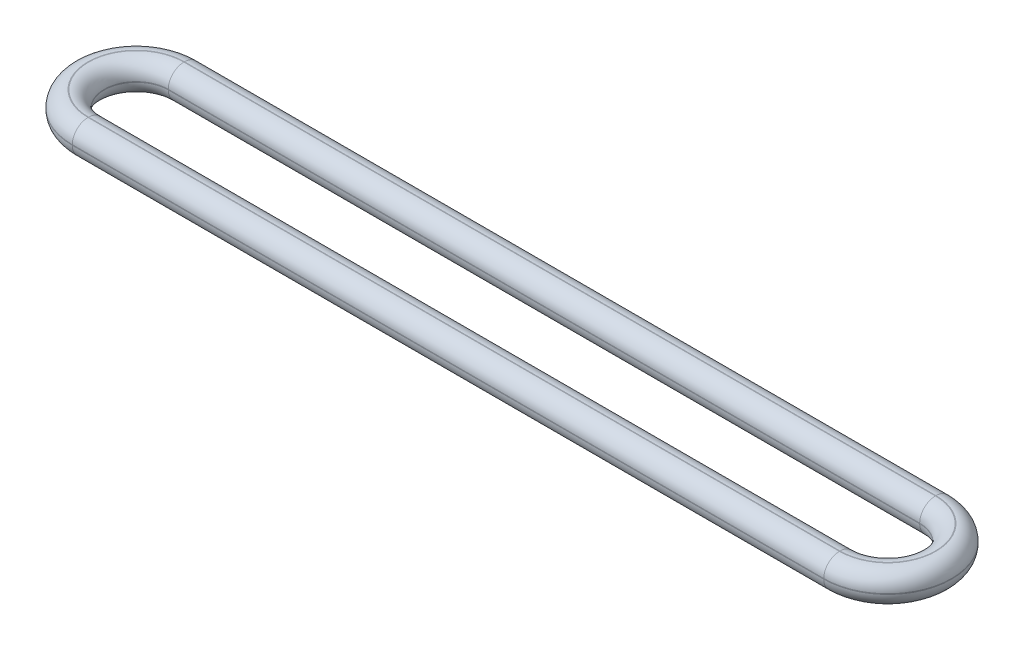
ISO-10303-21;
HEADER;
FILE_DESCRIPTION(('STEP AP214'),'2;1');
FILE_NAME('part.step','',(''),(''),'','','');
FILE_SCHEMA(('AUTOMOTIVE_DESIGN { 1 0 10303 214 1 1 1 1 }'));
ENDSEC;
DATA;
#1=APPLICATION_CONTEXT('core data for automotive mechanical design processes');
#2=APPLICATION_PROTOCOL_DEFINITION('international standard','automotive_design',2000,#1);
#3=PRODUCT_CONTEXT('',#1,'mechanical');
#4=PRODUCT('Part','Part','',(#3));
#5=PRODUCT_RELATED_PRODUCT_CATEGORY('part','',(#4));
#6=PRODUCT_DEFINITION_FORMATION('','',#4);
#7=PRODUCT_DEFINITION_CONTEXT('part definition',#1,'design');
#8=PRODUCT_DEFINITION('design','',#6,#7);
#9=PRODUCT_DEFINITION_SHAPE('','',#8);
#10=(LENGTH_UNIT() NAMED_UNIT(*) SI_UNIT(.MILLI.,.METRE.));
#11=(NAMED_UNIT(*) PLANE_ANGLE_UNIT() SI_UNIT($,.RADIAN.));
#12=(NAMED_UNIT(*) SI_UNIT($,.STERADIAN.) SOLID_ANGLE_UNIT());
#13=UNCERTAINTY_MEASURE_WITH_UNIT(LENGTH_MEASURE(1.E-05),#10,'distance_accuracy_value','');
#14=(GEOMETRIC_REPRESENTATION_CONTEXT(3) GLOBAL_UNCERTAINTY_ASSIGNED_CONTEXT((#13)) GLOBAL_UNIT_ASSIGNED_CONTEXT((#10,
#11,#12)) REPRESENTATION_CONTEXT('',''));
#15=CARTESIAN_POINT('',(0.,0.,0.));
#16=DIRECTION('',(0.,0.,1.));
#17=DIRECTION('',(1.,0.,0.));
#18=AXIS2_PLACEMENT_3D('',#15,#16,#17);
#19=CARTESIAN_POINT('',(0.,1.,0.));
#20=DIRECTION('',(0.,1.,0.));
#21=DIRECTION('',(0.,0.,1.));
#22=AXIS2_PLACEMENT_3D('',#19,#20,#21);
#23=PLANE('',#22);
#24=DIRECTION('',(-1.,0.,0.));
#25=VECTOR('',#24,1.);
#26=CARTESIAN_POINT('',(0.,1.,-1.49));
#27=LINE('',#26,#25);
#28=CARTESIAN_POINT('',(0.,1.,-1.49));
#29=VERTEX_POINT('',#28);
#30=CARTESIAN_POINT('',(23.5,1.,-1.49));
#31=VERTEX_POINT('',#30);
#32=EDGE_CURVE('E52',#29,#31,#27,.F.);
#33=ORIENTED_EDGE('',*,*,#32,.T.);
#34=CARTESIAN_POINT('',(23.5,1.,0.));
#35=DIRECTION('',(0.,1.,0.));
#36=DIRECTION('',(0.,0.,1.));
#37=AXIS2_PLACEMENT_3D('',#34,#35,#36);
#38=CIRCLE('',#37,1.49);
#39=CARTESIAN_POINT('',(23.5,1.,1.49));
#40=VERTEX_POINT('',#39);
#41=EDGE_CURVE('E237',#31,#40,#38,.F.);
#42=ORIENTED_EDGE('',*,*,#41,.T.);
#43=DIRECTION('',(1.,0.,0.));
#44=VECTOR('',#43,1.);
#45=CARTESIAN_POINT('',(0.,1.,1.49));
#46=LINE('',#45,#44);
#47=CARTESIAN_POINT('',(0.,1.,1.49));
#48=VERTEX_POINT('',#47);
#49=EDGE_CURVE('E233',#40,#48,#46,.F.);
#50=ORIENTED_EDGE('',*,*,#49,.T.);
#51=CARTESIAN_POINT('',(0.,1.,0.));
#52=DIRECTION('',(0.,1.,0.));
#53=DIRECTION('',(0.,0.,1.));
#54=AXIS2_PLACEMENT_3D('',#51,#52,#53);
#55=CIRCLE('',#54,1.49);
#56=EDGE_CURVE('E57',#48,#29,#55,.F.);
#57=ORIENTED_EDGE('',*,*,#56,.T.);
#58=EDGE_LOOP('',(#33,#42,#50,#57));
#59=FACE_BOUND('',#58,.T.);
#60=CARTESIAN_POINT('',(23.5,1.,0.));
#61=DIRECTION('',(0.,1.,0.));
#62=DIRECTION('',(0.,0.,1.));
#63=AXIS2_PLACEMENT_3D('',#60,#61,#62);
#64=CIRCLE('',#63,1.51);
#65=CARTESIAN_POINT('',(23.5,1.,1.51000000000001));
#66=VERTEX_POINT('',#65);
#67=CARTESIAN_POINT('',(23.5,1.,-1.51));
#68=VERTEX_POINT('',#67);
#69=EDGE_CURVE('E228',#66,#68,#64,.T.);
#70=ORIENTED_EDGE('',*,*,#69,.T.);
#71=DIRECTION('',(-1.,0.,0.));
#72=VECTOR('',#71,1.);
#73=CARTESIAN_POINT('',(0.,1.,-1.51));
#74=LINE('',#73,#72);
#75=CARTESIAN_POINT('',(0.,1.,-1.51));
#76=VERTEX_POINT('',#75);
#77=EDGE_CURVE('E230',#68,#76,#74,.T.);
#78=ORIENTED_EDGE('',*,*,#77,.T.);
#79=CARTESIAN_POINT('',(0.,1.,0.));
#80=DIRECTION('',(0.,1.,0.));
#81=DIRECTION('',(0.,0.,1.));
#82=AXIS2_PLACEMENT_3D('',#79,#80,#81);
#83=CIRCLE('',#82,1.51);
#84=CARTESIAN_POINT('',(0.,1.,1.51));
#85=VERTEX_POINT('',#84);
#86=EDGE_CURVE('E224',#76,#85,#83,.T.);
#87=ORIENTED_EDGE('',*,*,#86,.T.);
#88=DIRECTION('',(1.,0.,0.));
#89=VECTOR('',#88,1.);
#90=CARTESIAN_POINT('',(23.5,1.,1.51000000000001));
#91=LINE('',#90,#89);
#92=EDGE_CURVE('E226',#85,#66,#91,.T.);
#93=ORIENTED_EDGE('',*,*,#92,.T.);
#94=EDGE_LOOP('',(#70,#78,#87,#93));
#95=FACE_BOUND('',#94,.T.);
#96=ADVANCED_FACE('F35',(#59,#95),#23,.T.);
#97=CARTESIAN_POINT('',(0.,0.,0.));
#98=DIRECTION('',(0.,1.,0.));
#99=DIRECTION('',(0.,0.,1.));
#100=AXIS2_PLACEMENT_3D('',#97,#98,#99);
#101=PLANE('',#100);
#102=DIRECTION('',(-1.,0.,0.));
#103=VECTOR('',#102,1.);
#104=CARTESIAN_POINT('',(0.,0.,-1.49));
#105=LINE('',#104,#103);
#106=CARTESIAN_POINT('',(23.5,0.,-1.49));
#107=VERTEX_POINT('',#106);
#108=CARTESIAN_POINT('',(0.,0.,-1.49));
#109=VERTEX_POINT('',#108);
#110=EDGE_CURVE('E188',#107,#109,#105,.T.);
#111=ORIENTED_EDGE('',*,*,#110,.T.);
#112=CARTESIAN_POINT('',(0.,0.,0.));
#113=DIRECTION('',(0.,1.,0.));
#114=DIRECTION('',(0.,0.,1.));
#115=AXIS2_PLACEMENT_3D('',#112,#113,#114);
#116=CIRCLE('',#115,1.49);
#117=CARTESIAN_POINT('',(0.,0.,1.49));
#118=VERTEX_POINT('',#117);
#119=EDGE_CURVE('E190',#109,#118,#116,.T.);
#120=ORIENTED_EDGE('',*,*,#119,.T.);
#121=DIRECTION('',(1.,0.,0.));
#122=VECTOR('',#121,1.);
#123=CARTESIAN_POINT('',(23.5,0.,1.49));
#124=LINE('',#123,#122);
#125=CARTESIAN_POINT('',(23.5,0.,1.49));
#126=VERTEX_POINT('',#125);
#127=EDGE_CURVE('E184',#118,#126,#124,.T.);
#128=ORIENTED_EDGE('',*,*,#127,.T.);
#129=CARTESIAN_POINT('',(23.5,0.,0.));
#130=DIRECTION('',(0.,1.,0.));
#131=DIRECTION('',(0.,0.,1.));
#132=AXIS2_PLACEMENT_3D('',#129,#130,#131);
#133=CIRCLE('',#132,1.49);
#134=EDGE_CURVE('E186',#126,#107,#133,.T.);
#135=ORIENTED_EDGE('',*,*,#134,.T.);
#136=EDGE_LOOP('',(#111,#120,#128,#135));
#137=FACE_BOUND('',#136,.T.);
#138=CARTESIAN_POINT('',(23.5,0.,0.));
#139=DIRECTION('',(0.,1.,0.));
#140=DIRECTION('',(0.,0.,1.));
#141=AXIS2_PLACEMENT_3D('',#138,#139,#140);
#142=CIRCLE('',#141,1.51);
#143=CARTESIAN_POINT('',(23.5,0.,-1.51));
#144=VERTEX_POINT('',#143);
#145=CARTESIAN_POINT('',(23.5,0.,1.51000000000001));
#146=VERTEX_POINT('',#145);
#147=EDGE_CURVE('E153',#144,#146,#142,.F.);
#148=ORIENTED_EDGE('',*,*,#147,.T.);
#149=DIRECTION('',(1.,0.,0.));
#150=VECTOR('',#149,1.);
#151=CARTESIAN_POINT('',(0.,0.,1.51));
#152=LINE('',#151,#150);
#153=CARTESIAN_POINT('',(0.,0.,1.51));
#154=VERTEX_POINT('',#153);
#155=EDGE_CURVE('E182',#146,#154,#152,.F.);
#156=ORIENTED_EDGE('',*,*,#155,.T.);
#157=CARTESIAN_POINT('',(0.,0.,0.));
#158=DIRECTION('',(0.,1.,0.));
#159=DIRECTION('',(0.,0.,1.));
#160=AXIS2_PLACEMENT_3D('',#157,#158,#159);
#161=CIRCLE('',#160,1.51);
#162=CARTESIAN_POINT('',(0.,0.,-1.51));
#163=VERTEX_POINT('',#162);
#164=EDGE_CURVE('E156',#154,#163,#161,.F.);
#165=ORIENTED_EDGE('',*,*,#164,.T.);
#166=DIRECTION('',(-1.,0.,0.));
#167=VECTOR('',#166,1.);
#168=CARTESIAN_POINT('',(0.,0.,-1.51));
#169=LINE('',#168,#167);
#170=EDGE_CURVE('E148',#163,#144,#169,.F.);
#171=ORIENTED_EDGE('',*,*,#170,.T.);
#172=EDGE_LOOP('',(#148,#156,#165,#171));
#173=FACE_BOUND('',#172,.T.);
#174=ADVANCED_FACE('F150',(#137,#173),#101,.F.);
#175=CARTESIAN_POINT('',(0.,1.,0.));
#176=DIRECTION('',(0.,-1.,0.));
#177=DIRECTION('',(0.,0.,-1.));
#178=AXIS2_PLACEMENT_3D('',#175,#176,#177);
#179=CYLINDRICAL_SURFACE('',#178,2.);
#180=DIRECTION('',(0.,-1.,0.));
#181=VECTOR('',#180,1.);
#182=CARTESIAN_POINT('',(0.,1.,-2.));
#183=LINE('',#182,#181);
#184=CARTESIAN_POINT('',(0.,0.51,-2.));
#185=VERTEX_POINT('',#184);
#186=CARTESIAN_POINT('',(0.,0.49,-2.));
#187=VERTEX_POINT('',#186);
#188=EDGE_CURVE('E294',#185,#187,#183,.T.);
#189=ORIENTED_EDGE('',*,*,#188,.T.);
#190=CARTESIAN_POINT('',(0.,0.49,0.));
#191=DIRECTION('',(0.,1.,0.));
#192=DIRECTION('',(0.,0.,1.));
#193=AXIS2_PLACEMENT_3D('',#190,#191,#192);
#194=CIRCLE('',#193,2.);
#195=CARTESIAN_POINT('',(0.,0.49,2.));
#196=VERTEX_POINT('',#195);
#197=EDGE_CURVE('E214',#187,#196,#194,.T.);
#198=ORIENTED_EDGE('',*,*,#197,.T.);
#199=DIRECTION('',(0.,-1.,0.));
#200=VECTOR('',#199,1.);
#201=CARTESIAN_POINT('',(0.,1.,2.));
#202=LINE('',#201,#200);
#203=CARTESIAN_POINT('',(0.,0.51,2.));
#204=VERTEX_POINT('',#203);
#205=EDGE_CURVE('E174',#204,#196,#202,.T.);
#206=ORIENTED_EDGE('',*,*,#205,.F.);
#207=CARTESIAN_POINT('',(0.,0.51,0.));
#208=DIRECTION('',(0.,1.,0.));
#209=DIRECTION('',(0.,0.,1.));
#210=AXIS2_PLACEMENT_3D('',#207,#208,#209);
#211=CIRCLE('',#210,2.);
#212=EDGE_CURVE('E212',#204,#185,#211,.F.);
#213=ORIENTED_EDGE('',*,*,#212,.T.);
#214=EDGE_LOOP('',(#189,#198,#206,#213));
#215=FACE_BOUND('',#214,.T.);
#216=ADVANCED_FACE('F291',(#215),#179,.T.);
#217=CARTESIAN_POINT('',(23.5,1.,2.00000000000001));
#218=DIRECTION('',(0.,0.,-1.));
#219=DIRECTION('',(-1.,0.,0.));
#220=AXIS2_PLACEMENT_3D('',#217,#218,#219);
#221=PLANE('',#220);
#222=ORIENTED_EDGE('',*,*,#205,.T.);
#223=DIRECTION('',(1.,0.,0.));
#224=VECTOR('',#223,1.);
#225=CARTESIAN_POINT('',(23.5,0.49,2.00000000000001));
#226=LINE('',#225,#224);
#227=CARTESIAN_POINT('',(23.5,0.49,2.00000000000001));
#228=VERTEX_POINT('',#227);
#229=EDGE_CURVE('E209',#196,#228,#226,.T.);
#230=ORIENTED_EDGE('',*,*,#229,.T.);
#231=DIRECTION('',(0.,-1.,0.));
#232=VECTOR('',#231,1.);
#233=CARTESIAN_POINT('',(23.5,1.,2.00000000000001));
#234=LINE('',#233,#232);
#235=CARTESIAN_POINT('',(23.5,0.51,2.00000000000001));
#236=VERTEX_POINT('',#235);
#237=EDGE_CURVE('E177',#236,#228,#234,.T.);
#238=ORIENTED_EDGE('',*,*,#237,.F.);
#239=DIRECTION('',(1.,0.,0.));
#240=VECTOR('',#239,1.);
#241=CARTESIAN_POINT('',(0.,0.51,2.));
#242=LINE('',#241,#240);
#243=EDGE_CURVE('E207',#236,#204,#242,.F.);
#244=ORIENTED_EDGE('',*,*,#243,.T.);
#245=EDGE_LOOP('',(#222,#230,#238,#244));
#246=FACE_BOUND('',#245,.T.);
#247=ADVANCED_FACE('F286',(#246),#221,.F.);
#248=CARTESIAN_POINT('',(23.5,1.,0.));
#249=DIRECTION('',(0.,-1.,0.));
#250=DIRECTION('',(0.,0.,-1.));
#251=AXIS2_PLACEMENT_3D('',#248,#249,#250);
#252=CYLINDRICAL_SURFACE('',#251,2.);
#253=DIRECTION('',(0.,-1.,0.));
#254=VECTOR('',#253,1.);
#255=CARTESIAN_POINT('',(23.5,1.,-2.));
#256=LINE('',#255,#254);
#257=CARTESIAN_POINT('',(23.5,0.51,-2.));
#258=VERTEX_POINT('',#257);
#259=CARTESIAN_POINT('',(23.5,0.49,-2.));
#260=VERTEX_POINT('',#259);
#261=EDGE_CURVE('E304',#258,#260,#256,.T.);
#262=ORIENTED_EDGE('',*,*,#261,.F.);
#263=CARTESIAN_POINT('',(23.5,0.51,0.));
#264=DIRECTION('',(0.,1.,0.));
#265=DIRECTION('',(0.,0.,1.));
#266=AXIS2_PLACEMENT_3D('',#263,#264,#265);
#267=CIRCLE('',#266,2.);
#268=EDGE_CURVE('E11',#258,#236,#267,.F.);
#269=ORIENTED_EDGE('',*,*,#268,.T.);
#270=ORIENTED_EDGE('',*,*,#237,.T.);
#271=CARTESIAN_POINT('',(23.5,0.49,0.));
#272=DIRECTION('',(0.,1.,0.));
#273=DIRECTION('',(0.,0.,1.));
#274=AXIS2_PLACEMENT_3D('',#271,#272,#273);
#275=CIRCLE('',#274,2.);
#276=EDGE_CURVE('E44',#228,#260,#275,.T.);
#277=ORIENTED_EDGE('',*,*,#276,.T.);
#278=EDGE_LOOP('',(#262,#269,#270,#277));
#279=FACE_BOUND('',#278,.T.);
#280=ADVANCED_FACE('F302',(#279),#252,.T.);
#281=CARTESIAN_POINT('',(0.,1.,-2.));
#282=DIRECTION('',(0.,0.,1.));
#283=DIRECTION('',(1.,0.,0.));
#284=AXIS2_PLACEMENT_3D('',#281,#282,#283);
#285=PLANE('',#284);
#286=ORIENTED_EDGE('',*,*,#261,.T.);
#287=DIRECTION('',(-1.,0.,0.));
#288=VECTOR('',#287,1.);
#289=CARTESIAN_POINT('',(0.,0.49,-2.));
#290=LINE('',#289,#288);
#291=EDGE_CURVE('E165',#260,#187,#290,.T.);
#292=ORIENTED_EDGE('',*,*,#291,.T.);
#293=ORIENTED_EDGE('',*,*,#188,.F.);
#294=DIRECTION('',(-1.,0.,0.));
#295=VECTOR('',#294,1.);
#296=CARTESIAN_POINT('',(23.5,0.51,-2.));
#297=LINE('',#296,#295);
#298=EDGE_CURVE('E216',#185,#258,#297,.F.);
#299=ORIENTED_EDGE('',*,*,#298,.T.);
#300=EDGE_LOOP('',(#286,#292,#293,#299));
#301=FACE_BOUND('',#300,.T.);
#302=ADVANCED_FACE('F386',(#301),#285,.F.);
#303=CARTESIAN_POINT('',(0.,1.,0.));
#304=DIRECTION('',(0.,-1.,0.));
#305=DIRECTION('',(0.,0.,-1.));
#306=AXIS2_PLACEMENT_3D('',#303,#304,#305);
#307=CYLINDRICAL_SURFACE('',#306,1.);
#308=DIRECTION('',(0.,-1.,0.));
#309=VECTOR('',#308,1.);
#310=CARTESIAN_POINT('',(0.,1.,1.));
#311=LINE('',#310,#309);
#312=CARTESIAN_POINT('',(0.,0.51,1.));
#313=VERTEX_POINT('',#312);
#314=CARTESIAN_POINT('',(0.,0.49,1.));
#315=VERTEX_POINT('',#314);
#316=EDGE_CURVE('E308',#313,#315,#311,.T.);
#317=ORIENTED_EDGE('',*,*,#316,.T.);
#318=CARTESIAN_POINT('',(0.,0.49,0.));
#319=DIRECTION('',(0.,1.,0.));
#320=DIRECTION('',(0.,0.,1.));
#321=AXIS2_PLACEMENT_3D('',#318,#319,#320);
#322=CIRCLE('',#321,1.);
#323=CARTESIAN_POINT('',(0.,0.49,-1.));
#324=VERTEX_POINT('',#323);
#325=EDGE_CURVE('E195',#315,#324,#322,.F.);
#326=ORIENTED_EDGE('',*,*,#325,.T.);
#327=DIRECTION('',(0.,-1.,0.));
#328=VECTOR('',#327,1.);
#329=CARTESIAN_POINT('',(0.,1.,-1.));
#330=LINE('',#329,#328);
#331=CARTESIAN_POINT('',(0.,0.51,-1.));
#332=VERTEX_POINT('',#331);
#333=EDGE_CURVE('E250',#332,#324,#330,.T.);
#334=ORIENTED_EDGE('',*,*,#333,.F.);
#335=CARTESIAN_POINT('',(0.,0.51,0.));
#336=DIRECTION('',(0.,1.,0.));
#337=DIRECTION('',(0.,0.,1.));
#338=AXIS2_PLACEMENT_3D('',#335,#336,#337);
#339=CIRCLE('',#338,1.);
#340=EDGE_CURVE('E193',#332,#313,#339,.T.);
#341=ORIENTED_EDGE('',*,*,#340,.T.);
#342=EDGE_LOOP('',(#317,#326,#334,#341));
#343=FACE_BOUND('',#342,.T.);
#344=ADVANCED_FACE('F326',(#343),#307,.F.);
#345=CARTESIAN_POINT('',(23.5,1.,1.));
#346=DIRECTION('',(0.,0.,-1.));
#347=DIRECTION('',(-1.,0.,0.));
#348=AXIS2_PLACEMENT_3D('',#345,#346,#347);
#349=PLANE('',#348);
#350=DIRECTION('',(0.,-1.,0.));
#351=VECTOR('',#350,1.);
#352=CARTESIAN_POINT('',(23.5,1.,1.));
#353=LINE('',#352,#351);
#354=CARTESIAN_POINT('',(23.5,0.51,1.));
#355=VERTEX_POINT('',#354);
#356=CARTESIAN_POINT('',(23.5,0.49,1.));
#357=VERTEX_POINT('',#356);
#358=EDGE_CURVE('E311',#355,#357,#353,.T.);
#359=ORIENTED_EDGE('',*,*,#358,.T.);
#360=DIRECTION('',(1.,0.,0.));
#361=VECTOR('',#360,1.);
#362=CARTESIAN_POINT('',(0.,0.49,1.));
#363=LINE('',#362,#361);
#364=EDGE_CURVE('E222',#357,#315,#363,.F.);
#365=ORIENTED_EDGE('',*,*,#364,.T.);
#366=ORIENTED_EDGE('',*,*,#316,.F.);
#367=DIRECTION('',(1.,0.,0.));
#368=VECTOR('',#367,1.);
#369=CARTESIAN_POINT('',(23.5,0.51,1.));
#370=LINE('',#369,#368);
#371=EDGE_CURVE('E220',#313,#355,#370,.T.);
#372=ORIENTED_EDGE('',*,*,#371,.T.);
#373=EDGE_LOOP('',(#359,#365,#366,#372));
#374=FACE_BOUND('',#373,.T.);
#375=ADVANCED_FACE('F346',(#374),#349,.T.);
#376=CARTESIAN_POINT('',(23.5,1.,0.));
#377=DIRECTION('',(0.,-1.,0.));
#378=DIRECTION('',(0.,0.,-1.));
#379=AXIS2_PLACEMENT_3D('',#376,#377,#378);
#380=CYLINDRICAL_SURFACE('',#379,1.);
#381=DIRECTION('',(0.,-1.,0.));
#382=VECTOR('',#381,1.);
#383=CARTESIAN_POINT('',(23.5,1.,-1.));
#384=LINE('',#383,#382);
#385=CARTESIAN_POINT('',(23.5,0.51,-1.));
#386=VERTEX_POINT('',#385);
#387=CARTESIAN_POINT('',(23.5,0.49,-1.));
#388=VERTEX_POINT('',#387);
#389=EDGE_CURVE('E314',#386,#388,#384,.T.);
#390=ORIENTED_EDGE('',*,*,#389,.T.);
#391=CARTESIAN_POINT('',(23.5,0.49,0.));
#392=DIRECTION('',(0.,1.,0.));
#393=DIRECTION('',(0.,0.,1.));
#394=AXIS2_PLACEMENT_3D('',#391,#392,#393);
#395=CIRCLE('',#394,1.);
#396=EDGE_CURVE('E205',#388,#357,#395,.F.);
#397=ORIENTED_EDGE('',*,*,#396,.T.);
#398=ORIENTED_EDGE('',*,*,#358,.F.);
#399=CARTESIAN_POINT('',(23.5,0.51,0.));
#400=DIRECTION('',(0.,1.,0.));
#401=DIRECTION('',(0.,0.,1.));
#402=AXIS2_PLACEMENT_3D('',#399,#400,#401);
#403=CIRCLE('',#402,1.);
#404=EDGE_CURVE('E202',#355,#386,#403,.T.);
#405=ORIENTED_EDGE('',*,*,#404,.T.);
#406=EDGE_LOOP('',(#390,#397,#398,#405));
#407=FACE_BOUND('',#406,.T.);
#408=ADVANCED_FACE('F349',(#407),#380,.F.);
#409=CARTESIAN_POINT('',(0.,1.,-1.));
#410=DIRECTION('',(0.,0.,1.));
#411=DIRECTION('',(1.,0.,0.));
#412=AXIS2_PLACEMENT_3D('',#409,#410,#411);
#413=PLANE('',#412);
#414=ORIENTED_EDGE('',*,*,#333,.T.);
#415=DIRECTION('',(-1.,0.,0.));
#416=VECTOR('',#415,1.);
#417=CARTESIAN_POINT('',(23.5,0.49,-1.));
#418=LINE('',#417,#416);
#419=EDGE_CURVE('E200',#324,#388,#418,.F.);
#420=ORIENTED_EDGE('',*,*,#419,.T.);
#421=ORIENTED_EDGE('',*,*,#389,.F.);
#422=DIRECTION('',(-1.,0.,0.));
#423=VECTOR('',#422,1.);
#424=CARTESIAN_POINT('',(0.,0.51,-1.));
#425=LINE('',#424,#423);
#426=EDGE_CURVE('E198',#386,#332,#425,.T.);
#427=ORIENTED_EDGE('',*,*,#426,.T.);
#428=EDGE_LOOP('',(#414,#420,#421,#427));
#429=FACE_BOUND('',#428,.T.);
#430=ADVANCED_FACE('F320',(#429),#413,.T.);
#431=CARTESIAN_POINT('',(23.5,0.49,0.));
#432=DIRECTION('',(0.,1.,0.));
#433=DIRECTION('',(0.,0.,1.));
#434=AXIS2_PLACEMENT_3D('',#431,#432,#433);
#435=TOROIDAL_SURFACE('',#434,1.49,0.49);
#436=CARTESIAN_POINT('',(23.5,0.49,1.49));
#437=DIRECTION('',(-1.,0.,0.));
#438=DIRECTION('',(0.,0.,1.));
#439=AXIS2_PLACEMENT_3D('',#436,#437,#438);
#440=CIRCLE('',#439,0.49);
#441=EDGE_CURVE('E244',#357,#126,#440,.T.);
#442=ORIENTED_EDGE('',*,*,#441,.F.);
#443=ORIENTED_EDGE('',*,*,#396,.F.);
#444=CARTESIAN_POINT('',(23.5,0.49,-1.49));
#445=DIRECTION('',(-1.,0.,0.));
#446=DIRECTION('',(0.,0.,1.));
#447=AXIS2_PLACEMENT_3D('',#444,#445,#446);
#448=CIRCLE('',#447,0.49);
#449=EDGE_CURVE('E247',#107,#388,#448,.T.);
#450=ORIENTED_EDGE('',*,*,#449,.F.);
#451=ORIENTED_EDGE('',*,*,#134,.F.);
#452=EDGE_LOOP('',(#442,#443,#450,#451));
#453=FACE_BOUND('',#452,.T.);
#454=ADVANCED_FACE('F353',(#453),#435,.T.);
#455=CARTESIAN_POINT('',(0.,0.49,-1.49));
#456=DIRECTION('',(1.,0.,0.));
#457=DIRECTION('',(0.,0.,-1.));
#458=AXIS2_PLACEMENT_3D('',#455,#456,#457);
#459=CYLINDRICAL_SURFACE('',#458,0.49);
#460=ORIENTED_EDGE('',*,*,#449,.T.);
#461=ORIENTED_EDGE('',*,*,#419,.F.);
#462=CARTESIAN_POINT('',(0.,0.49,-1.49));
#463=DIRECTION('',(-1.,0.,0.));
#464=DIRECTION('',(0.,0.,1.));
#465=AXIS2_PLACEMENT_3D('',#462,#463,#464);
#466=CIRCLE('',#465,0.49);
#467=EDGE_CURVE('E242',#109,#324,#466,.T.);
#468=ORIENTED_EDGE('',*,*,#467,.F.);
#469=ORIENTED_EDGE('',*,*,#110,.F.);
#470=EDGE_LOOP('',(#460,#461,#468,#469));
#471=FACE_BOUND('',#470,.T.);
#472=ADVANCED_FACE('F358',(#471),#459,.T.);
#473=CARTESIAN_POINT('',(0.,0.49,1.49));
#474=DIRECTION('',(-1.,0.,0.));
#475=DIRECTION('',(0.,0.,1.));
#476=AXIS2_PLACEMENT_3D('',#473,#474,#475);
#477=CYLINDRICAL_SURFACE('',#476,0.49);
#478=ORIENTED_EDGE('',*,*,#441,.T.);
#479=ORIENTED_EDGE('',*,*,#127,.F.);
#480=CARTESIAN_POINT('',(0.,0.49,1.49));
#481=DIRECTION('',(-1.,0.,0.));
#482=DIRECTION('',(0.,0.,1.));
#483=AXIS2_PLACEMENT_3D('',#480,#481,#482);
#484=CIRCLE('',#483,0.49);
#485=EDGE_CURVE('E240',#315,#118,#484,.T.);
#486=ORIENTED_EDGE('',*,*,#485,.F.);
#487=ORIENTED_EDGE('',*,*,#364,.F.);
#488=EDGE_LOOP('',(#478,#479,#486,#487));
#489=FACE_BOUND('',#488,.T.);
#490=ADVANCED_FACE('F364',(#489),#477,.T.);
#491=CARTESIAN_POINT('',(0.,0.49,0.));
#492=DIRECTION('',(0.,1.,0.));
#493=DIRECTION('',(0.,0.,1.));
#494=AXIS2_PLACEMENT_3D('',#491,#492,#493);
#495=TOROIDAL_SURFACE('',#494,1.49,0.49);
#496=ORIENTED_EDGE('',*,*,#467,.T.);
#497=ORIENTED_EDGE('',*,*,#325,.F.);
#498=ORIENTED_EDGE('',*,*,#485,.T.);
#499=ORIENTED_EDGE('',*,*,#119,.F.);
#500=EDGE_LOOP('',(#496,#497,#498,#499));
#501=FACE_BOUND('',#500,.T.);
#502=ADVANCED_FACE('F367',(#501),#495,.T.);
#503=CARTESIAN_POINT('',(0.,0.49,-1.51));
#504=DIRECTION('',(-1.,0.,0.));
#505=DIRECTION('',(0.,0.,1.));
#506=AXIS2_PLACEMENT_3D('',#503,#504,#505);
#507=CYLINDRICAL_SURFACE('',#506,0.49);
#508=CARTESIAN_POINT('',(23.5,0.49,-1.51));
#509=DIRECTION('',(1.,0.,0.));
#510=DIRECTION('',(0.,0.,-1.));
#511=AXIS2_PLACEMENT_3D('',#508,#509,#510);
#512=CIRCLE('',#511,0.49);
#513=EDGE_CURVE('E163',#144,#260,#512,.T.);
#514=ORIENTED_EDGE('',*,*,#513,.F.);
#515=ORIENTED_EDGE('',*,*,#170,.F.);
#516=CARTESIAN_POINT('',(0.,0.49,-1.51));
#517=DIRECTION('',(-1.,0.,0.));
#518=DIRECTION('',(0.,0.,1.));
#519=AXIS2_PLACEMENT_3D('',#516,#517,#518);
#520=CIRCLE('',#519,0.49);
#521=EDGE_CURVE('E168',#187,#163,#520,.T.);
#522=ORIENTED_EDGE('',*,*,#521,.F.);
#523=ORIENTED_EDGE('',*,*,#291,.F.);
#524=EDGE_LOOP('',(#514,#515,#522,#523));
#525=FACE_BOUND('',#524,.T.);
#526=ADVANCED_FACE('F164',(#525),#507,.T.);
#527=CARTESIAN_POINT('',(0.,0.49,0.));
#528=DIRECTION('',(0.,1.,0.));
#529=DIRECTION('',(0.,0.,1.));
#530=AXIS2_PLACEMENT_3D('',#527,#528,#529);
#531=TOROIDAL_SURFACE('',#530,1.51,0.49);
#532=ORIENTED_EDGE('',*,*,#521,.T.);
#533=ORIENTED_EDGE('',*,*,#164,.F.);
#534=CARTESIAN_POINT('',(0.,0.49,1.51));
#535=DIRECTION('',(1.,0.,0.));
#536=DIRECTION('',(0.,1.,0.));
#537=AXIS2_PLACEMENT_3D('',#534,#535,#536);
#538=CIRCLE('',#537,0.49);
#539=EDGE_CURVE('E169',#196,#154,#538,.T.);
#540=ORIENTED_EDGE('',*,*,#539,.F.);
#541=ORIENTED_EDGE('',*,*,#197,.F.);
#542=EDGE_LOOP('',(#532,#533,#540,#541));
#543=FACE_BOUND('',#542,.T.);
#544=ADVANCED_FACE('F296',(#543),#531,.T.);
#545=CARTESIAN_POINT('',(23.5,0.49,0.));
#546=DIRECTION('',(0.,1.,0.));
#547=DIRECTION('',(0.,0.,1.));
#548=AXIS2_PLACEMENT_3D('',#545,#546,#547);
#549=TOROIDAL_SURFACE('',#548,1.51,0.49);
#550=ORIENTED_EDGE('',*,*,#513,.T.);
#551=ORIENTED_EDGE('',*,*,#276,.F.);
#552=CARTESIAN_POINT('',(23.5,0.49,1.51000000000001));
#553=DIRECTION('',(-1.,0.,0.));
#554=DIRECTION('',(0.,0.,1.));
#555=AXIS2_PLACEMENT_3D('',#552,#553,#554);
#556=CIRCLE('',#555,0.49);
#557=EDGE_CURVE('E173',#146,#228,#556,.T.);
#558=ORIENTED_EDGE('',*,*,#557,.F.);
#559=ORIENTED_EDGE('',*,*,#147,.F.);
#560=EDGE_LOOP('',(#550,#551,#558,#559));
#561=FACE_BOUND('',#560,.T.);
#562=ADVANCED_FACE('F172',(#561),#549,.T.);
#563=CARTESIAN_POINT('',(23.5,0.49,1.51000000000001));
#564=DIRECTION('',(1.,0.,0.));
#565=DIRECTION('',(0.,0.,-1.));
#566=AXIS2_PLACEMENT_3D('',#563,#564,#565);
#567=CYLINDRICAL_SURFACE('',#566,0.49);
#568=ORIENTED_EDGE('',*,*,#539,.T.);
#569=ORIENTED_EDGE('',*,*,#155,.F.);
#570=ORIENTED_EDGE('',*,*,#557,.T.);
#571=ORIENTED_EDGE('',*,*,#229,.F.);
#572=EDGE_LOOP('',(#568,#569,#570,#571));
#573=FACE_BOUND('',#572,.T.);
#574=ADVANCED_FACE('F299',(#573),#567,.T.);
#575=CARTESIAN_POINT('',(0.,0.51,0.));
#576=DIRECTION('',(0.,1.,0.));
#577=DIRECTION('',(0.,0.,1.));
#578=AXIS2_PLACEMENT_3D('',#575,#576,#577);
#579=TOROIDAL_SURFACE('',#578,1.49,0.49);
#580=CARTESIAN_POINT('',(0.,0.51,-1.49));
#581=DIRECTION('',(1.,0.,0.));
#582=DIRECTION('',(0.,0.,-1.));
#583=AXIS2_PLACEMENT_3D('',#580,#581,#582);
#584=CIRCLE('',#583,0.49);
#585=EDGE_CURVE('E259',#29,#332,#584,.T.);
#586=ORIENTED_EDGE('',*,*,#585,.F.);
#587=ORIENTED_EDGE('',*,*,#56,.F.);
#588=CARTESIAN_POINT('',(0.,0.51,1.49));
#589=DIRECTION('',(1.,0.,0.));
#590=DIRECTION('',(0.,0.,-1.));
#591=AXIS2_PLACEMENT_3D('',#588,#589,#590);
#592=CIRCLE('',#591,0.49);
#593=EDGE_CURVE('E252',#313,#48,#592,.T.);
#594=ORIENTED_EDGE('',*,*,#593,.F.);
#595=ORIENTED_EDGE('',*,*,#340,.F.);
#596=EDGE_LOOP('',(#586,#587,#594,#595));
#597=FACE_BOUND('',#596,.T.);
#598=ADVANCED_FACE('F331',(#597),#579,.T.);
#599=CARTESIAN_POINT('',(23.5,0.51,1.49));
#600=DIRECTION('',(1.,0.,0.));
#601=DIRECTION('',(0.,0.,-1.));
#602=AXIS2_PLACEMENT_3D('',#599,#600,#601);
#603=CYLINDRICAL_SURFACE('',#602,0.49);
#604=ORIENTED_EDGE('',*,*,#593,.T.);
#605=ORIENTED_EDGE('',*,*,#49,.F.);
#606=CARTESIAN_POINT('',(23.5,0.51,1.49));
#607=DIRECTION('',(1.,0.,0.));
#608=DIRECTION('',(0.,0.,-1.));
#609=AXIS2_PLACEMENT_3D('',#606,#607,#608);
#610=CIRCLE('',#609,0.49);
#611=EDGE_CURVE('E257',#355,#40,#610,.T.);
#612=ORIENTED_EDGE('',*,*,#611,.F.);
#613=ORIENTED_EDGE('',*,*,#371,.F.);
#614=EDGE_LOOP('',(#604,#605,#612,#613));
#615=FACE_BOUND('',#614,.T.);
#616=ADVANCED_FACE('F343',(#615),#603,.T.);
#617=CARTESIAN_POINT('',(0.,0.51,-1.49));
#618=DIRECTION('',(-1.,0.,0.));
#619=DIRECTION('',(0.,0.,1.));
#620=AXIS2_PLACEMENT_3D('',#617,#618,#619);
#621=CYLINDRICAL_SURFACE('',#620,0.49);
#622=ORIENTED_EDGE('',*,*,#585,.T.);
#623=ORIENTED_EDGE('',*,*,#426,.F.);
#624=CARTESIAN_POINT('',(23.5,0.51,-1.49));
#625=DIRECTION('',(1.,0.,0.));
#626=DIRECTION('',(0.,0.,-1.));
#627=AXIS2_PLACEMENT_3D('',#624,#625,#626);
#628=CIRCLE('',#627,0.49);
#629=EDGE_CURVE('E255',#31,#386,#628,.T.);
#630=ORIENTED_EDGE('',*,*,#629,.F.);
#631=ORIENTED_EDGE('',*,*,#32,.F.);
#632=EDGE_LOOP('',(#622,#623,#630,#631));
#633=FACE_BOUND('',#632,.T.);
#634=ADVANCED_FACE('F334',(#633),#621,.T.);
#635=CARTESIAN_POINT('',(23.5,0.51,0.));
#636=DIRECTION('',(0.,1.,0.));
#637=DIRECTION('',(0.,0.,1.));
#638=AXIS2_PLACEMENT_3D('',#635,#636,#637);
#639=TOROIDAL_SURFACE('',#638,1.49,0.49);
#640=ORIENTED_EDGE('',*,*,#611,.T.);
#641=ORIENTED_EDGE('',*,*,#41,.F.);
#642=ORIENTED_EDGE('',*,*,#629,.T.);
#643=ORIENTED_EDGE('',*,*,#404,.F.);
#644=EDGE_LOOP('',(#640,#641,#642,#643));
#645=FACE_BOUND('',#644,.T.);
#646=ADVANCED_FACE('F338',(#645),#639,.T.);
#647=CARTESIAN_POINT('',(0.,0.51,1.51));
#648=DIRECTION('',(-1.,0.,0.));
#649=DIRECTION('',(0.,0.,1.));
#650=AXIS2_PLACEMENT_3D('',#647,#648,#649);
#651=CYLINDRICAL_SURFACE('',#650,0.49);
#652=CARTESIAN_POINT('',(0.,0.51,1.51));
#653=DIRECTION('',(-1.,0.,0.));
#654=DIRECTION('',(0.,0.,1.));
#655=AXIS2_PLACEMENT_3D('',#652,#653,#654);
#656=CIRCLE('',#655,0.49);
#657=EDGE_CURVE('E267',#204,#85,#656,.T.);
#658=ORIENTED_EDGE('',*,*,#657,.F.);
#659=ORIENTED_EDGE('',*,*,#243,.F.);
#660=CARTESIAN_POINT('',(23.5,0.51,1.51000000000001));
#661=DIRECTION('',(1.,0.,0.));
#662=DIRECTION('',(0.,0.,-1.));
#663=AXIS2_PLACEMENT_3D('',#660,#661,#662);
#664=CIRCLE('',#663,0.49);
#665=EDGE_CURVE('E39',#66,#236,#664,.T.);
#666=ORIENTED_EDGE('',*,*,#665,.F.);
#667=ORIENTED_EDGE('',*,*,#92,.F.);
#668=EDGE_LOOP('',(#658,#659,#666,#667));
#669=FACE_BOUND('',#668,.T.);
#670=ADVANCED_FACE('F37',(#669),#651,.T.);
#671=CARTESIAN_POINT('',(23.5,0.51,0.));
#672=DIRECTION('',(0.,1.,0.));
#673=DIRECTION('',(0.,0.,1.));
#674=AXIS2_PLACEMENT_3D('',#671,#672,#673);
#675=TOROIDAL_SURFACE('',#674,1.51,0.49);
#676=ORIENTED_EDGE('',*,*,#665,.T.);
#677=ORIENTED_EDGE('',*,*,#268,.F.);
#678=CARTESIAN_POINT('',(23.5,0.51,-1.51));
#679=DIRECTION('',(-1.,0.,0.));
#680=DIRECTION('',(0.,0.,1.));
#681=AXIS2_PLACEMENT_3D('',#678,#679,#680);
#682=CIRCLE('',#681,0.49);
#683=EDGE_CURVE('E266',#68,#258,#682,.T.);
#684=ORIENTED_EDGE('',*,*,#683,.F.);
#685=ORIENTED_EDGE('',*,*,#69,.F.);
#686=EDGE_LOOP('',(#676,#677,#684,#685));
#687=FACE_BOUND('',#686,.T.);
#688=ADVANCED_FACE('F278',(#687),#675,.T.);
#689=CARTESIAN_POINT('',(0.,0.51,0.));
#690=DIRECTION('',(0.,1.,0.));
#691=DIRECTION('',(0.,0.,1.));
#692=AXIS2_PLACEMENT_3D('',#689,#690,#691);
#693=TOROIDAL_SURFACE('',#692,1.51,0.49);
#694=ORIENTED_EDGE('',*,*,#657,.T.);
#695=ORIENTED_EDGE('',*,*,#86,.F.);
#696=CARTESIAN_POINT('',(0.,0.51,-1.51));
#697=DIRECTION('',(1.,0.,0.));
#698=DIRECTION('',(0.,0.,-1.));
#699=AXIS2_PLACEMENT_3D('',#696,#697,#698);
#700=CIRCLE('',#699,0.49);
#701=EDGE_CURVE('E264',#185,#76,#700,.T.);
#702=ORIENTED_EDGE('',*,*,#701,.F.);
#703=ORIENTED_EDGE('',*,*,#212,.F.);
#704=EDGE_LOOP('',(#694,#695,#702,#703));
#705=FACE_BOUND('',#704,.T.);
#706=ADVANCED_FACE('F530',(#705),#693,.T.);
#707=CARTESIAN_POINT('',(0.,0.51,-1.51));
#708=DIRECTION('',(1.,0.,0.));
#709=DIRECTION('',(0.,0.,-1.));
#710=AXIS2_PLACEMENT_3D('',#707,#708,#709);
#711=CYLINDRICAL_SURFACE('',#710,0.49);
#712=ORIENTED_EDGE('',*,*,#683,.T.);
#713=ORIENTED_EDGE('',*,*,#298,.F.);
#714=ORIENTED_EDGE('',*,*,#701,.T.);
#715=ORIENTED_EDGE('',*,*,#77,.F.);
#716=EDGE_LOOP('',(#712,#713,#714,#715));
#717=FACE_BOUND('',#716,.T.);
#718=ADVANCED_FACE('F538',(#717),#711,.T.);
#719=CLOSED_SHELL('',(#96,#174,#216,#247,#280,#302,#344,#375,#408,#430,#454,#472,#490,#502,#526,
#544,#562,#574,#598,#616,#634,#646,#670,#688,#706,#718));
#720=MANIFOLD_SOLID_BREP('B2',#719);
#721=ADVANCED_BREP_SHAPE_REPRESENTATION('',(#18,#720),#14);
#722=SHAPE_DEFINITION_REPRESENTATION(#9,#721);
ENDSEC;
END-ISO-10303-21;
